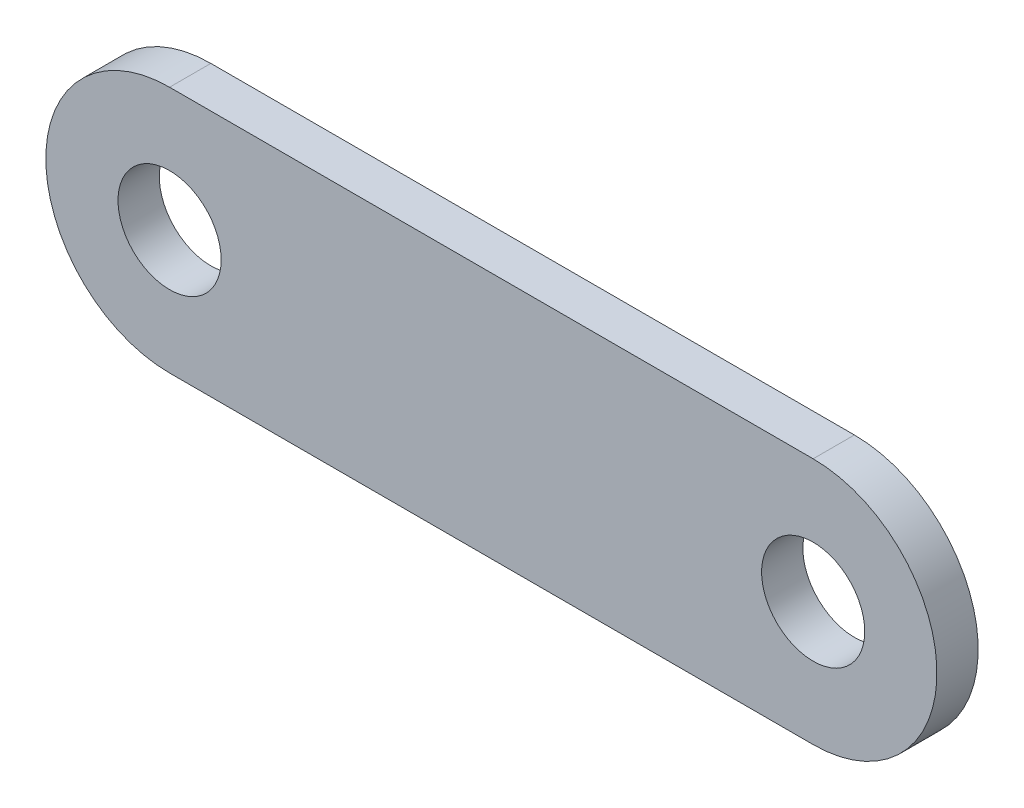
ISO-10303-21;
HEADER;
FILE_DESCRIPTION(('STEP AP214'),'2;1');
FILE_NAME('part.step','',(''),(''),'','','');
FILE_SCHEMA(('AUTOMOTIVE_DESIGN { 1 0 10303 214 1 1 1 1 }'));
ENDSEC;
DATA;
#1=APPLICATION_CONTEXT('core data for automotive mechanical design processes');
#2=APPLICATION_PROTOCOL_DEFINITION('international standard','automotive_design',2000,#1);
#3=PRODUCT_CONTEXT('',#1,'mechanical');
#4=PRODUCT('Part','Part','',(#3));
#5=PRODUCT_RELATED_PRODUCT_CATEGORY('part','',(#4));
#6=PRODUCT_DEFINITION_FORMATION('','',#4);
#7=PRODUCT_DEFINITION_CONTEXT('part definition',#1,'design');
#8=PRODUCT_DEFINITION('design','',#6,#7);
#9=PRODUCT_DEFINITION_SHAPE('','',#8);
#10=(LENGTH_UNIT() NAMED_UNIT(*) SI_UNIT(.MILLI.,.METRE.));
#11=(NAMED_UNIT(*) PLANE_ANGLE_UNIT() SI_UNIT($,.RADIAN.));
#12=(NAMED_UNIT(*) SI_UNIT($,.STERADIAN.) SOLID_ANGLE_UNIT());
#13=UNCERTAINTY_MEASURE_WITH_UNIT(LENGTH_MEASURE(1.E-05),#10,'distance_accuracy_value','');
#14=(GEOMETRIC_REPRESENTATION_CONTEXT(3) GLOBAL_UNCERTAINTY_ASSIGNED_CONTEXT((#13)) GLOBAL_UNIT_ASSIGNED_CONTEXT((#10,
#11,#12)) REPRESENTATION_CONTEXT('',''));
#15=CARTESIAN_POINT('',(0.,0.,0.));
#16=DIRECTION('',(0.,0.,1.));
#17=DIRECTION('',(1.,0.,0.));
#18=AXIS2_PLACEMENT_3D('',#15,#16,#17);
#19=CARTESIAN_POINT('',(0.,0.,2.54));
#20=DIRECTION('',(0.,0.,1.));
#21=DIRECTION('',(1.,0.,0.));
#22=AXIS2_PLACEMENT_3D('',#19,#20,#21);
#23=PLANE('',#22);
#24=CARTESIAN_POINT('',(0.,0.,2.54));
#25=DIRECTION('',(0.,0.,1.));
#26=DIRECTION('',(1.,0.,0.));
#27=AXIS2_PLACEMENT_3D('',#24,#25,#26);
#28=CIRCLE('',#27,3.175);
#29=CARTESIAN_POINT('',(3.175,0.,2.54));
#30=VERTEX_POINT('',#29);
#31=EDGE_CURVE('E99',#30,#30,#28,.T.);
#32=ORIENTED_EDGE('',*,*,#31,.F.);
#33=EDGE_LOOP('',(#32));
#34=FACE_BOUND('',#33,.T.);
#35=CARTESIAN_POINT('',(0.,0.,2.54));
#36=DIRECTION('',(0.,0.,1.));
#37=DIRECTION('',(1.,0.,0.));
#38=AXIS2_PLACEMENT_3D('',#35,#36,#37);
#39=CIRCLE('',#38,7.62);
#40=CARTESIAN_POINT('',(0.,7.62,2.54));
#41=VERTEX_POINT('',#40);
#42=CARTESIAN_POINT('',(0.,-7.62,2.54));
#43=VERTEX_POINT('',#42);
#44=EDGE_CURVE('E84',#41,#43,#39,.T.);
#45=ORIENTED_EDGE('',*,*,#44,.T.);
#46=DIRECTION('',(1.,0.,0.));
#47=VECTOR('',#46,1.);
#48=CARTESIAN_POINT('',(0.,-7.62,2.54));
#49=LINE('',#48,#47);
#50=CARTESIAN_POINT('',(39.624,-7.62,2.54));
#51=VERTEX_POINT('',#50);
#52=EDGE_CURVE('E79',#43,#51,#49,.T.);
#53=ORIENTED_EDGE('',*,*,#52,.T.);
#54=CARTESIAN_POINT('',(39.624,0.,2.54));
#55=DIRECTION('',(0.,0.,1.));
#56=DIRECTION('',(-1.,0.,0.));
#57=AXIS2_PLACEMENT_3D('',#54,#55,#56);
#58=CIRCLE('',#57,7.62);
#59=CARTESIAN_POINT('',(39.624,7.62,2.54));
#60=VERTEX_POINT('',#59);
#61=EDGE_CURVE('E82',#51,#60,#58,.T.);
#62=ORIENTED_EDGE('',*,*,#61,.T.);
#63=DIRECTION('',(-1.,0.,0.));
#64=VECTOR('',#63,1.);
#65=CARTESIAN_POINT('',(0.,7.62,2.54));
#66=LINE('',#65,#64);
#67=EDGE_CURVE('E49',#60,#41,#66,.T.);
#68=ORIENTED_EDGE('',*,*,#67,.T.);
#69=EDGE_LOOP('',(#45,#53,#62,#68));
#70=FACE_BOUND('',#69,.T.);
#71=CARTESIAN_POINT('',(39.624,0.,2.54));
#72=DIRECTION('',(0.,0.,1.));
#73=DIRECTION('',(1.,0.,0.));
#74=AXIS2_PLACEMENT_3D('',#71,#72,#73);
#75=CIRCLE('',#74,3.175);
#76=CARTESIAN_POINT('',(42.799,0.,2.54));
#77=VERTEX_POINT('',#76);
#78=EDGE_CURVE('E114',#77,#77,#75,.T.);
#79=ORIENTED_EDGE('',*,*,#78,.F.);
#80=EDGE_LOOP('',(#79));
#81=FACE_BOUND('',#80,.T.);
#82=ADVANCED_FACE('F32',(#34,#70,#81),#23,.T.);
#83=CARTESIAN_POINT('',(0.,0.,0.));
#84=DIRECTION('',(0.,0.,1.));
#85=DIRECTION('',(1.,0.,0.));
#86=AXIS2_PLACEMENT_3D('',#83,#84,#85);
#87=PLANE('',#86);
#88=CARTESIAN_POINT('',(0.,0.,0.));
#89=DIRECTION('',(0.,0.,1.));
#90=DIRECTION('',(1.,0.,0.));
#91=AXIS2_PLACEMENT_3D('',#88,#89,#90);
#92=CIRCLE('',#91,3.175);
#93=CARTESIAN_POINT('',(3.175,0.,0.));
#94=VERTEX_POINT('',#93);
#95=EDGE_CURVE('E111',#94,#94,#92,.T.);
#96=ORIENTED_EDGE('',*,*,#95,.T.);
#97=EDGE_LOOP('',(#96));
#98=FACE_BOUND('',#97,.T.);
#99=CARTESIAN_POINT('',(0.,0.,0.));
#100=DIRECTION('',(0.,0.,1.));
#101=DIRECTION('',(1.,0.,0.));
#102=AXIS2_PLACEMENT_3D('',#99,#100,#101);
#103=CIRCLE('',#102,7.62);
#104=CARTESIAN_POINT('',(0.,7.62,0.));
#105=VERTEX_POINT('',#104);
#106=CARTESIAN_POINT('',(0.,-7.62,0.));
#107=VERTEX_POINT('',#106);
#108=EDGE_CURVE('E96',#105,#107,#103,.T.);
#109=ORIENTED_EDGE('',*,*,#108,.F.);
#110=DIRECTION('',(-1.,0.,0.));
#111=VECTOR('',#110,1.);
#112=CARTESIAN_POINT('',(0.,7.62,0.));
#113=LINE('',#112,#111);
#114=CARTESIAN_POINT('',(39.624,7.62,0.));
#115=VERTEX_POINT('',#114);
#116=EDGE_CURVE('E72',#115,#105,#113,.T.);
#117=ORIENTED_EDGE('',*,*,#116,.F.);
#118=CARTESIAN_POINT('',(39.624,0.,0.));
#119=DIRECTION('',(0.,0.,1.));
#120=DIRECTION('',(-1.,0.,0.));
#121=AXIS2_PLACEMENT_3D('',#118,#119,#120);
#122=CIRCLE('',#121,7.62);
#123=CARTESIAN_POINT('',(39.624,-7.62,0.));
#124=VERTEX_POINT('',#123);
#125=EDGE_CURVE('E66',#124,#115,#122,.T.);
#126=ORIENTED_EDGE('',*,*,#125,.F.);
#127=DIRECTION('',(1.,0.,0.));
#128=VECTOR('',#127,1.);
#129=CARTESIAN_POINT('',(0.,-7.62,0.));
#130=LINE('',#129,#128);
#131=EDGE_CURVE('E88',#107,#124,#130,.T.);
#132=ORIENTED_EDGE('',*,*,#131,.F.);
#133=EDGE_LOOP('',(#109,#117,#126,#132));
#134=FACE_BOUND('',#133,.T.);
#135=CARTESIAN_POINT('',(39.624,0.,0.));
#136=DIRECTION('',(0.,0.,1.));
#137=DIRECTION('',(1.,0.,0.));
#138=AXIS2_PLACEMENT_3D('',#135,#136,#137);
#139=CIRCLE('',#138,3.175);
#140=CARTESIAN_POINT('',(42.799,0.,0.));
#141=VERTEX_POINT('',#140);
#142=EDGE_CURVE('E117',#141,#141,#139,.T.);
#143=ORIENTED_EDGE('',*,*,#142,.T.);
#144=EDGE_LOOP('',(#143));
#145=FACE_BOUND('',#144,.T.);
#146=ADVANCED_FACE('F107',(#98,#134,#145),#87,.F.);
#147=CARTESIAN_POINT('',(0.,0.,2.54));
#148=DIRECTION('',(0.,0.,-1.));
#149=DIRECTION('',(-1.,0.,0.));
#150=AXIS2_PLACEMENT_3D('',#147,#148,#149);
#151=CYLINDRICAL_SURFACE('',#150,7.62);
#152=ORIENTED_EDGE('',*,*,#108,.T.);
#153=DIRECTION('',(0.,0.,-1.));
#154=VECTOR('',#153,1.);
#155=CARTESIAN_POINT('',(0.,-7.62,2.54));
#156=LINE('',#155,#154);
#157=EDGE_CURVE('E11',#43,#107,#156,.T.);
#158=ORIENTED_EDGE('',*,*,#157,.F.);
#159=ORIENTED_EDGE('',*,*,#44,.F.);
#160=DIRECTION('',(0.,0.,-1.));
#161=VECTOR('',#160,1.);
#162=CARTESIAN_POINT('',(0.,7.62,2.54));
#163=LINE('',#162,#161);
#164=EDGE_CURVE('E92',#41,#105,#163,.T.);
#165=ORIENTED_EDGE('',*,*,#164,.T.);
#166=EDGE_LOOP('',(#152,#158,#159,#165));
#167=FACE_BOUND('',#166,.T.);
#168=ADVANCED_FACE('F34',(#167),#151,.T.);
#169=CARTESIAN_POINT('',(0.,-7.62,2.54));
#170=DIRECTION('',(0.,1.,0.));
#171=DIRECTION('',(0.,0.,1.));
#172=AXIS2_PLACEMENT_3D('',#169,#170,#171);
#173=PLANE('',#172);
#174=ORIENTED_EDGE('',*,*,#131,.T.);
#175=DIRECTION('',(0.,0.,-1.));
#176=VECTOR('',#175,1.);
#177=CARTESIAN_POINT('',(39.624,-7.62,2.54));
#178=LINE('',#177,#176);
#179=EDGE_CURVE('E41',#51,#124,#178,.T.);
#180=ORIENTED_EDGE('',*,*,#179,.F.);
#181=ORIENTED_EDGE('',*,*,#52,.F.);
#182=ORIENTED_EDGE('',*,*,#157,.T.);
#183=EDGE_LOOP('',(#174,#180,#181,#182));
#184=FACE_BOUND('',#183,.T.);
#185=ADVANCED_FACE('F87',(#184),#173,.F.);
#186=CARTESIAN_POINT('',(39.624,0.,2.54));
#187=DIRECTION('',(0.,0.,-1.));
#188=DIRECTION('',(-1.,0.,0.));
#189=AXIS2_PLACEMENT_3D('',#186,#187,#188);
#190=CYLINDRICAL_SURFACE('',#189,7.62);
#191=ORIENTED_EDGE('',*,*,#125,.T.);
#192=DIRECTION('',(0.,0.,-1.));
#193=VECTOR('',#192,1.);
#194=CARTESIAN_POINT('',(39.624,7.62,2.54));
#195=LINE('',#194,#193);
#196=EDGE_CURVE('E89',#60,#115,#195,.T.);
#197=ORIENTED_EDGE('',*,*,#196,.F.);
#198=ORIENTED_EDGE('',*,*,#61,.F.);
#199=ORIENTED_EDGE('',*,*,#179,.T.);
#200=EDGE_LOOP('',(#191,#197,#198,#199));
#201=FACE_BOUND('',#200,.T.);
#202=ADVANCED_FACE('F90',(#201),#190,.T.);
#203=CARTESIAN_POINT('',(0.,7.62,2.54));
#204=DIRECTION('',(0.,-1.,0.));
#205=DIRECTION('',(0.,0.,-1.));
#206=AXIS2_PLACEMENT_3D('',#203,#204,#205);
#207=PLANE('',#206);
#208=ORIENTED_EDGE('',*,*,#116,.T.);
#209=ORIENTED_EDGE('',*,*,#164,.F.);
#210=ORIENTED_EDGE('',*,*,#67,.F.);
#211=ORIENTED_EDGE('',*,*,#196,.T.);
#212=EDGE_LOOP('',(#208,#209,#210,#211));
#213=FACE_BOUND('',#212,.T.);
#214=ADVANCED_FACE('F104',(#213),#207,.F.);
#215=CARTESIAN_POINT('',(0.,0.,2.54));
#216=DIRECTION('',(0.,0.,-1.));
#217=DIRECTION('',(-1.,0.,0.));
#218=AXIS2_PLACEMENT_3D('',#215,#216,#217);
#219=CYLINDRICAL_SURFACE('',#218,3.175);
#220=ORIENTED_EDGE('',*,*,#31,.T.);
#221=EDGE_LOOP('',(#220));
#222=FACE_BOUND('',#221,.T.);
#223=ORIENTED_EDGE('',*,*,#95,.F.);
#224=EDGE_LOOP('',(#223));
#225=FACE_BOUND('',#224,.T.);
#226=ADVANCED_FACE('F135',(#222,#225),#219,.F.);
#227=CARTESIAN_POINT('',(39.624,0.,2.54));
#228=DIRECTION('',(0.,0.,-1.));
#229=DIRECTION('',(-1.,0.,0.));
#230=AXIS2_PLACEMENT_3D('',#227,#228,#229);
#231=CYLINDRICAL_SURFACE('',#230,3.175);
#232=ORIENTED_EDGE('',*,*,#78,.T.);
#233=EDGE_LOOP('',(#232));
#234=FACE_BOUND('',#233,.T.);
#235=ORIENTED_EDGE('',*,*,#142,.F.);
#236=EDGE_LOOP('',(#235));
#237=FACE_BOUND('',#236,.T.);
#238=ADVANCED_FACE('F123',(#234,#237),#231,.F.);
#239=CLOSED_SHELL('',(#82,#146,#168,#185,#202,#214,#226,#238));
#240=MANIFOLD_SOLID_BREP('B2',#239);
#241=ADVANCED_BREP_SHAPE_REPRESENTATION('',(#18,#240),#14);
#242=SHAPE_DEFINITION_REPRESENTATION(#9,#241);
ENDSEC;
END-ISO-10303-21;
